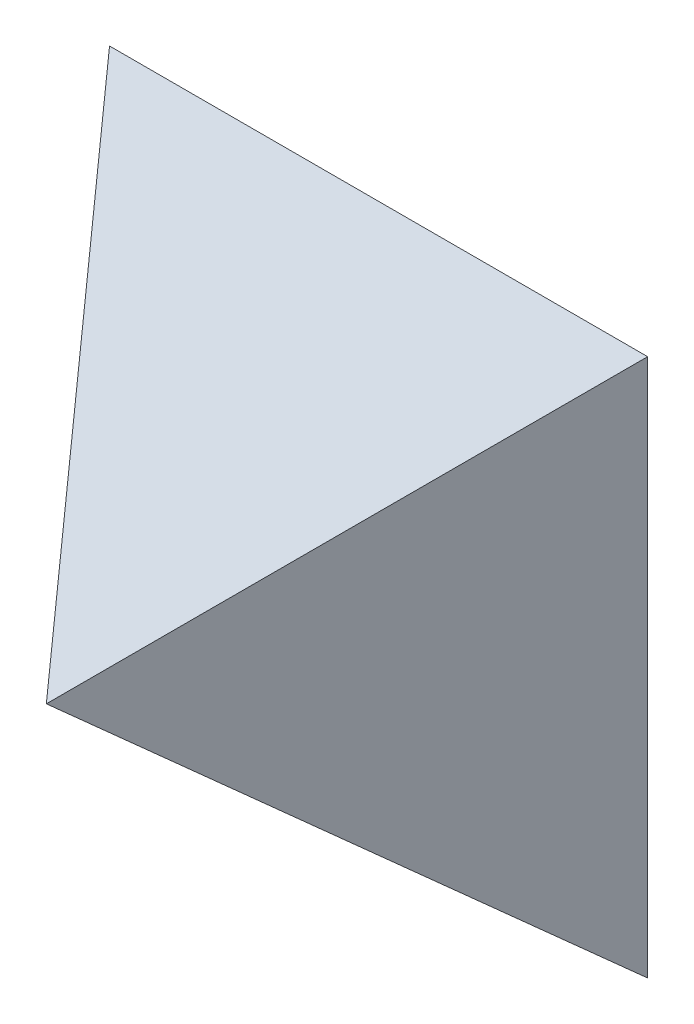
ISO-10303-21;
HEADER;
FILE_DESCRIPTION(('STEP AP214'),'2;1');
FILE_NAME('part.step','',(''),(''),'','','');
FILE_SCHEMA(('AUTOMOTIVE_DESIGN { 1 0 10303 214 1 1 1 1 }'));
ENDSEC;
DATA;
#1=APPLICATION_CONTEXT('core data for automotive mechanical design processes');
#2=APPLICATION_PROTOCOL_DEFINITION('international standard','automotive_design',2000,#1);
#3=PRODUCT_CONTEXT('',#1,'mechanical');
#4=PRODUCT('Part','Part','',(#3));
#5=PRODUCT_RELATED_PRODUCT_CATEGORY('part','',(#4));
#6=PRODUCT_DEFINITION_FORMATION('','',#4);
#7=PRODUCT_DEFINITION_CONTEXT('part definition',#1,'design');
#8=PRODUCT_DEFINITION('design','',#6,#7);
#9=PRODUCT_DEFINITION_SHAPE('','',#8);
#10=(LENGTH_UNIT() NAMED_UNIT(*) SI_UNIT(.MILLI.,.METRE.));
#11=(NAMED_UNIT(*) PLANE_ANGLE_UNIT() SI_UNIT($,.RADIAN.));
#12=(NAMED_UNIT(*) SI_UNIT($,.STERADIAN.) SOLID_ANGLE_UNIT());
#13=UNCERTAINTY_MEASURE_WITH_UNIT(LENGTH_MEASURE(1.E-05),#10,'distance_accuracy_value','');
#14=(GEOMETRIC_REPRESENTATION_CONTEXT(3) GLOBAL_UNCERTAINTY_ASSIGNED_CONTEXT((#13)) GLOBAL_UNIT_ASSIGNED_CONTEXT((#10,
#11,#12)) REPRESENTATION_CONTEXT('',''));
#15=CARTESIAN_POINT('',(0.,0.,0.));
#16=DIRECTION('',(0.,0.,1.));
#17=DIRECTION('',(1.,0.,0.));
#18=AXIS2_PLACEMENT_3D('',#15,#16,#17);
#19=CARTESIAN_POINT('',(0.,0.,21600.));
#20=DIRECTION('',(0.,0.,1.));
#21=DIRECTION('',(1.,0.,0.));
#22=AXIS2_PLACEMENT_3D('',#19,#20,#21);
#23=PLANE('',#22);
#24=DIRECTION('',(0.,1.,0.));
#25=VECTOR('',#24,1.);
#26=CARTESIAN_POINT('',(17493.832225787,16.1631016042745,21600.));
#27=LINE('',#26,#25);
#28=CARTESIAN_POINT('',(17493.832225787,-17492.5017813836,21600.));
#29=VERTEX_POINT('',#28);
#30=CARTESIAN_POINT('',(17493.832225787,-17475.1720154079,21600.));
#31=VERTEX_POINT('',#30);
#32=EDGE_CURVE('E41',#29,#31,#27,.T.);
#33=ORIENTED_EDGE('',*,*,#32,.T.);
#34=DIRECTION('',(-1.,0.,0.));
#35=VECTOR('',#34,1.);
#36=CARTESIAN_POINT('',(-14.8326572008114,-17475.1720154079,21600.));
#37=LINE('',#36,#35);
#38=CARTESIAN_POINT('',(17476.5024598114,-17475.1720154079,21600.));
#39=VERTEX_POINT('',#38);
#40=EDGE_CURVE('E11',#31,#39,#37,.T.);
#41=ORIENTED_EDGE('',*,*,#40,.T.);
#42=DIRECTION('',(0.,-1.,0.));
#43=VECTOR('',#42,1.);
#44=CARTESIAN_POINT('',(17476.5024598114,-34983.8368983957,21600.));
#45=LINE('',#44,#43);
#46=CARTESIAN_POINT('',(17476.5024598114,-17492.5017813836,21600.));
#47=VERTEX_POINT('',#46);
#48=EDGE_CURVE('E97',#39,#47,#45,.T.);
#49=ORIENTED_EDGE('',*,*,#48,.T.);
#50=DIRECTION('',(1.,0.,0.));
#51=VECTOR('',#50,1.);
#52=CARTESIAN_POINT('',(34985.1673427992,-17492.5017813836,21600.));
#53=LINE('',#52,#51);
#54=EDGE_CURVE('E52',#47,#29,#53,.T.);
#55=ORIENTED_EDGE('',*,*,#54,.T.);
#56=EDGE_LOOP('',(#33,#41,#49,#55));
#57=FACE_BOUND('',#56,.T.);
#58=ADVANCED_FACE('F32',(#57),#23,.T.);
#59=CARTESIAN_POINT('',(0.,0.,0.));
#60=DIRECTION('',(0.,0.,1.));
#61=DIRECTION('',(1.,0.,0.));
#62=AXIS2_PLACEMENT_3D('',#59,#60,#61);
#63=PLANE('',#62);
#64=DIRECTION('',(0.,-1.,0.));
#65=VECTOR('',#64,1.);
#66=CARTESIAN_POINT('',(-14.8326572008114,16.1631016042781,0.));
#67=LINE('',#66,#65);
#68=CARTESIAN_POINT('',(-14.8326572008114,16.1631016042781,0.));
#69=VERTEX_POINT('',#68);
#70=CARTESIAN_POINT('',(-14.8326572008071,-34983.8368983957,0.));
#71=VERTEX_POINT('',#70);
#72=EDGE_CURVE('E77',#69,#71,#67,.T.);
#73=ORIENTED_EDGE('',*,*,#72,.F.);
#74=DIRECTION('',(-1.,0.,0.));
#75=VECTOR('',#74,1.);
#76=CARTESIAN_POINT('',(-14.8326572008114,16.1631016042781,0.));
#77=LINE('',#76,#75);
#78=CARTESIAN_POINT('',(34985.1673427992,16.1631016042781,0.));
#79=VERTEX_POINT('',#78);
#80=EDGE_CURVE('E95',#79,#69,#77,.T.);
#81=ORIENTED_EDGE('',*,*,#80,.F.);
#82=DIRECTION('',(0.,1.,0.));
#83=VECTOR('',#82,1.);
#84=CARTESIAN_POINT('',(34985.1673427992,16.1631016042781,0.));
#85=LINE('',#84,#83);
#86=CARTESIAN_POINT('',(34985.1673427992,-34983.8368983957,0.));
#87=VERTEX_POINT('',#86);
#88=EDGE_CURVE('E80',#87,#79,#85,.T.);
#89=ORIENTED_EDGE('',*,*,#88,.F.);
#90=DIRECTION('',(1.,0.,0.));
#91=VECTOR('',#90,1.);
#92=CARTESIAN_POINT('',(-14.8326572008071,-34983.8368983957,0.));
#93=LINE('',#92,#91);
#94=EDGE_CURVE('E72',#71,#87,#93,.T.);
#95=ORIENTED_EDGE('',*,*,#94,.F.);
#96=EDGE_LOOP('',(#73,#81,#89,#95));
#97=FACE_BOUND('',#96,.T.);
#98=ADVANCED_FACE('F74',(#97),#63,.F.);
#99=CARTESIAN_POINT('',(0.,-17492.5017813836,21600.));
#100=DIRECTION('',(0.,-0.777145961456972,0.629320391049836));
#101=DIRECTION('',(-1.,0.,0.));
#102=AXIS2_PLACEMENT_3D('',#99,#100,#101);
#103=PLANE('',#102);
#104=DIRECTION('',(0.532625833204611,0.532625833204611,0.657738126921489));
#105=VECTOR('',#104,1.);
#106=CARTESIAN_POINT('',(22438.9551565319,-12530.049084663,27728.11872462));
#107=LINE('',#106,#105);
#108=EDGE_CURVE('E85',#71,#47,#107,.T.);
#109=ORIENTED_EDGE('',*,*,#108,.F.);
#110=ORIENTED_EDGE('',*,*,#94,.T.);
#111=DIRECTION('',(-0.532625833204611,0.532625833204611,0.657738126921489));
#112=VECTOR('',#111,1.);
#113=CARTESIAN_POINT('',(12531.0020949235,-12529.67165052,27728.5848169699));
#114=LINE('',#113,#112);
#115=EDGE_CURVE('E36',#29,#87,#114,.F.);
#116=ORIENTED_EDGE('',*,*,#115,.F.);
#117=ORIENTED_EDGE('',*,*,#54,.F.);
#118=EDGE_LOOP('',(#109,#110,#116,#117));
#119=FACE_BOUND('',#118,.T.);
#120=ADVANCED_FACE('F34',(#119),#103,.T.);
#121=CARTESIAN_POINT('',(17493.832225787,3.5514615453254E-12,21600.));
#122=DIRECTION('',(0.777145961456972,0.,0.629320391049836));
#123=DIRECTION('',(0.,-1.,0.));
#124=AXIS2_PLACEMENT_3D('',#121,#122,#123);
#125=PLANE('',#124);
#126=ORIENTED_EDGE('',*,*,#115,.T.);
#127=ORIENTED_EDGE('',*,*,#88,.T.);
#128=DIRECTION('',(-0.532625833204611,-0.532625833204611,0.657738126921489));
#129=VECTOR('',#128,1.);
#130=CARTESIAN_POINT('',(22451.3686363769,-12517.635604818,15477.9523831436));
#131=LINE('',#130,#129);
#132=EDGE_CURVE('E88',#31,#79,#131,.F.);
#133=ORIENTED_EDGE('',*,*,#132,.F.);
#134=ORIENTED_EDGE('',*,*,#32,.F.);
#135=EDGE_LOOP('',(#126,#127,#133,#134));
#136=FACE_BOUND('',#135,.T.);
#137=ADVANCED_FACE('F106',(#136),#125,.T.);
#138=CARTESIAN_POINT('',(17476.5024598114,2.14037307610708E-12,21600.));
#139=DIRECTION('',(-0.777145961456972,0.,0.629320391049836));
#140=DIRECTION('',(0.,1.,0.));
#141=AXIS2_PLACEMENT_3D('',#138,#139,#140);
#142=PLANE('',#141);
#143=ORIENTED_EDGE('',*,*,#108,.T.);
#144=ORIENTED_EDGE('',*,*,#48,.F.);
#145=DIRECTION('',(-0.532625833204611,0.532625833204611,-0.657738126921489));
#146=VECTOR('',#145,1.);
#147=CARTESIAN_POINT('',(12518.9660492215,-12517.635604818,15477.9523831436));
#148=LINE('',#147,#146);
#149=EDGE_CURVE('E91',#69,#39,#148,.F.);
#150=ORIENTED_EDGE('',*,*,#149,.F.);
#151=ORIENTED_EDGE('',*,*,#72,.T.);
#152=EDGE_LOOP('',(#143,#144,#150,#151));
#153=FACE_BOUND('',#152,.T.);
#154=ADVANCED_FACE('F90',(#153),#142,.T.);
#155=CARTESIAN_POINT('',(0.,-17475.1720154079,21600.));
#156=DIRECTION('',(0.,0.777145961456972,0.629320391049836));
#157=DIRECTION('',(1.,0.,0.));
#158=AXIS2_PLACEMENT_3D('',#155,#156,#157);
#159=PLANE('',#158);
#160=ORIENTED_EDGE('',*,*,#132,.T.);
#161=ORIENTED_EDGE('',*,*,#80,.T.);
#162=ORIENTED_EDGE('',*,*,#149,.T.);
#163=ORIENTED_EDGE('',*,*,#40,.F.);
#164=EDGE_LOOP('',(#160,#161,#162,#163));
#165=FACE_BOUND('',#164,.T.);
#166=ADVANCED_FACE('F104',(#165),#159,.T.);
#167=CLOSED_SHELL('',(#58,#98,#120,#137,#154,#166));
#168=MANIFOLD_SOLID_BREP('B2',#167);
#169=ADVANCED_BREP_SHAPE_REPRESENTATION('',(#18,#168),#14);
#170=SHAPE_DEFINITION_REPRESENTATION(#9,#169);
ENDSEC;
END-ISO-10303-21;
